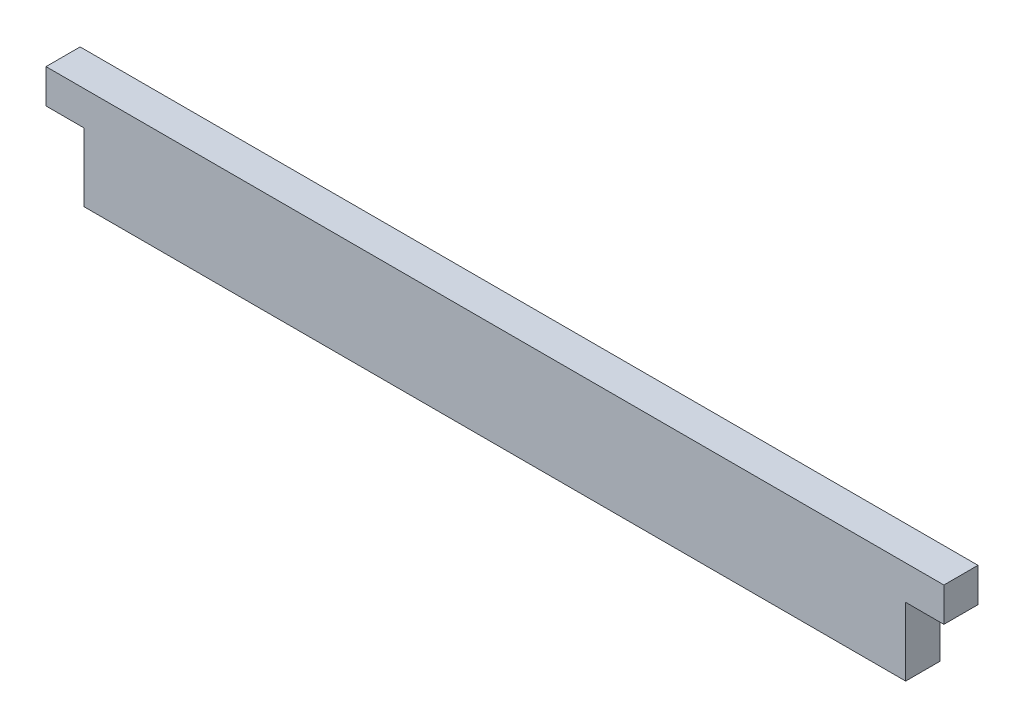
ISO-10303-21;
HEADER;
FILE_DESCRIPTION(('STEP AP214'),'2;1');
FILE_NAME('part.step','',(''),(''),'','','');
FILE_SCHEMA(('AUTOMOTIVE_DESIGN { 1 0 10303 214 1 1 1 1 }'));
ENDSEC;
DATA;
#1=APPLICATION_CONTEXT('core data for automotive mechanical design processes');
#2=APPLICATION_PROTOCOL_DEFINITION('international standard','automotive_design',2000,#1);
#3=PRODUCT_CONTEXT('',#1,'mechanical');
#4=PRODUCT('Part','Part','',(#3));
#5=PRODUCT_RELATED_PRODUCT_CATEGORY('part','',(#4));
#6=PRODUCT_DEFINITION_FORMATION('','',#4);
#7=PRODUCT_DEFINITION_CONTEXT('part definition',#1,'design');
#8=PRODUCT_DEFINITION('design','',#6,#7);
#9=PRODUCT_DEFINITION_SHAPE('','',#8);
#10=(LENGTH_UNIT() NAMED_UNIT(*) SI_UNIT(.MILLI.,.METRE.));
#11=(NAMED_UNIT(*) PLANE_ANGLE_UNIT() SI_UNIT($,.RADIAN.));
#12=(NAMED_UNIT(*) SI_UNIT($,.STERADIAN.) SOLID_ANGLE_UNIT());
#13=UNCERTAINTY_MEASURE_WITH_UNIT(LENGTH_MEASURE(1.E-05),#10,'distance_accuracy_value','');
#14=(GEOMETRIC_REPRESENTATION_CONTEXT(3) GLOBAL_UNCERTAINTY_ASSIGNED_CONTEXT((#13)) GLOBAL_UNIT_ASSIGNED_CONTEXT((#10,
#11,#12)) REPRESENTATION_CONTEXT('',''));
#15=CARTESIAN_POINT('',(0.,0.,0.));
#16=DIRECTION('',(0.,0.,1.));
#17=DIRECTION('',(1.,0.,0.));
#18=AXIS2_PLACEMENT_3D('',#15,#16,#17);
#19=CARTESIAN_POINT('',(80.01,0.,-3.175));
#20=DIRECTION('',(-1.,0.,0.));
#21=DIRECTION('',(0.,0.,1.));
#22=AXIS2_PLACEMENT_3D('',#19,#20,#21);
#23=PLANE('',#22);
#24=DIRECTION('',(0.,-1.,0.));
#25=VECTOR('',#24,1.);
#26=CARTESIAN_POINT('',(80.01,0.,0.));
#27=LINE('',#26,#25);
#28=CARTESIAN_POINT('',(80.01,6.35,0.));
#29=VERTEX_POINT('',#28);
#30=CARTESIAN_POINT('',(80.01,0.,0.));
#31=VERTEX_POINT('',#30);
#32=EDGE_CURVE('E129',#29,#31,#27,.T.);
#33=ORIENTED_EDGE('',*,*,#32,.T.);
#34=DIRECTION('',(0.,0.,1.));
#35=VECTOR('',#34,1.);
#36=CARTESIAN_POINT('',(80.01,0.,-3.175));
#37=LINE('',#36,#35);
#38=CARTESIAN_POINT('',(80.01,0.,-3.175));
#39=VERTEX_POINT('',#38);
#40=EDGE_CURVE('E11',#39,#31,#37,.T.);
#41=ORIENTED_EDGE('',*,*,#40,.F.);
#42=DIRECTION('',(0.,-1.,0.));
#43=VECTOR('',#42,1.);
#44=CARTESIAN_POINT('',(80.01,0.,-3.175));
#45=LINE('',#44,#43);
#46=CARTESIAN_POINT('',(80.01,6.35,-3.175));
#47=VERTEX_POINT('',#46);
#48=EDGE_CURVE('E51',#47,#39,#45,.T.);
#49=ORIENTED_EDGE('',*,*,#48,.F.);
#50=DIRECTION('',(0.,0.,1.));
#51=VECTOR('',#50,1.);
#52=CARTESIAN_POINT('',(80.01,6.35,-3.175));
#53=LINE('',#52,#51);
#54=EDGE_CURVE('E36',#47,#29,#53,.T.);
#55=ORIENTED_EDGE('',*,*,#54,.T.);
#56=EDGE_LOOP('',(#33,#41,#49,#55));
#57=FACE_BOUND('',#56,.T.);
#58=ADVANCED_FACE('F33',(#57),#23,.F.);
#59=CARTESIAN_POINT('',(0.,0.,-3.175));
#60=DIRECTION('',(0.,-1.,0.));
#61=DIRECTION('',(0.,0.,-1.));
#62=AXIS2_PLACEMENT_3D('',#59,#60,#61);
#63=PLANE('',#62);
#64=DIRECTION('',(1.,0.,0.));
#65=VECTOR('',#64,1.);
#66=CARTESIAN_POINT('',(0.,0.,0.));
#67=LINE('',#66,#65);
#68=CARTESIAN_POINT('',(3.556,0.,0.));
#69=VERTEX_POINT('',#68);
#70=EDGE_CURVE('E145',#69,#31,#67,.T.);
#71=ORIENTED_EDGE('',*,*,#70,.F.);
#72=DIRECTION('',(0.,0.,1.));
#73=VECTOR('',#72,1.);
#74=CARTESIAN_POINT('',(3.556,0.,-3.175));
#75=LINE('',#74,#73);
#76=CARTESIAN_POINT('',(3.556,0.,-3.175));
#77=VERTEX_POINT('',#76);
#78=EDGE_CURVE('E42',#77,#69,#75,.T.);
#79=ORIENTED_EDGE('',*,*,#78,.F.);
#80=DIRECTION('',(1.,0.,0.));
#81=VECTOR('',#80,1.);
#82=CARTESIAN_POINT('',(0.,0.,-3.175));
#83=LINE('',#82,#81);
#84=EDGE_CURVE('E109',#77,#39,#83,.T.);
#85=ORIENTED_EDGE('',*,*,#84,.T.);
#86=ORIENTED_EDGE('',*,*,#40,.T.);
#87=EDGE_LOOP('',(#71,#79,#85,#86));
#88=FACE_BOUND('',#87,.T.);
#89=ADVANCED_FACE('F172',(#88),#63,.T.);
#90=CARTESIAN_POINT('',(3.556,0.,-3.175));
#91=DIRECTION('',(1.,0.,0.));
#92=DIRECTION('',(0.,1.,0.));
#93=AXIS2_PLACEMENT_3D('',#90,#91,#92);
#94=PLANE('',#93);
#95=DIRECTION('',(0.,1.,0.));
#96=VECTOR('',#95,1.);
#97=CARTESIAN_POINT('',(3.556,0.,0.));
#98=LINE('',#97,#96);
#99=CARTESIAN_POINT('',(3.556,6.35,0.));
#100=VERTEX_POINT('',#99);
#101=EDGE_CURVE('E114',#69,#100,#98,.T.);
#102=ORIENTED_EDGE('',*,*,#101,.T.);
#103=DIRECTION('',(0.,0.,1.));
#104=VECTOR('',#103,1.);
#105=CARTESIAN_POINT('',(3.556,6.35,-3.175));
#106=LINE('',#105,#104);
#107=CARTESIAN_POINT('',(3.556,6.35,-3.175));
#108=VERTEX_POINT('',#107);
#109=EDGE_CURVE('E112',#108,#100,#106,.T.);
#110=ORIENTED_EDGE('',*,*,#109,.F.);
#111=DIRECTION('',(0.,1.,0.));
#112=VECTOR('',#111,1.);
#113=CARTESIAN_POINT('',(3.556,0.,-3.175));
#114=LINE('',#113,#112);
#115=EDGE_CURVE('E103',#77,#108,#114,.T.);
#116=ORIENTED_EDGE('',*,*,#115,.F.);
#117=ORIENTED_EDGE('',*,*,#78,.T.);
#118=EDGE_LOOP('',(#102,#110,#116,#117));
#119=FACE_BOUND('',#118,.T.);
#120=ADVANCED_FACE('F113',(#119),#94,.F.);
#121=CARTESIAN_POINT('',(0.,6.35,-3.175));
#122=DIRECTION('',(0.,1.,0.));
#123=DIRECTION('',(0.,0.,1.));
#124=AXIS2_PLACEMENT_3D('',#121,#122,#123);
#125=PLANE('',#124);
#126=DIRECTION('',(-1.,0.,0.));
#127=VECTOR('',#126,1.);
#128=CARTESIAN_POINT('',(0.,6.35,0.));
#129=LINE('',#128,#127);
#130=CARTESIAN_POINT('',(0.,6.35,0.));
#131=VERTEX_POINT('',#130);
#132=EDGE_CURVE('E142',#100,#131,#129,.T.);
#133=ORIENTED_EDGE('',*,*,#132,.T.);
#134=DIRECTION('',(0.,0.,1.));
#135=VECTOR('',#134,1.);
#136=CARTESIAN_POINT('',(0.,6.35,-3.175));
#137=LINE('',#136,#135);
#138=CARTESIAN_POINT('',(0.,6.35,-3.175));
#139=VERTEX_POINT('',#138);
#140=EDGE_CURVE('E117',#139,#131,#137,.T.);
#141=ORIENTED_EDGE('',*,*,#140,.F.);
#142=DIRECTION('',(-1.,0.,0.));
#143=VECTOR('',#142,1.);
#144=CARTESIAN_POINT('',(0.,6.35,-3.175));
#145=LINE('',#144,#143);
#146=EDGE_CURVE('E107',#108,#139,#145,.T.);
#147=ORIENTED_EDGE('',*,*,#146,.F.);
#148=ORIENTED_EDGE('',*,*,#109,.T.);
#149=EDGE_LOOP('',(#133,#141,#147,#148));
#150=FACE_BOUND('',#149,.T.);
#151=ADVANCED_FACE('F119',(#150),#125,.F.);
#152=CARTESIAN_POINT('',(0.,0.,-3.175));
#153=DIRECTION('',(1.,0.,0.));
#154=DIRECTION('',(0.,1.,0.));
#155=AXIS2_PLACEMENT_3D('',#152,#153,#154);
#156=PLANE('',#155);
#157=DIRECTION('',(0.,1.,0.));
#158=VECTOR('',#157,1.);
#159=CARTESIAN_POINT('',(0.,0.,0.));
#160=LINE('',#159,#158);
#161=CARTESIAN_POINT('',(0.,9.525,0.));
#162=VERTEX_POINT('',#161);
#163=EDGE_CURVE('E140',#131,#162,#160,.T.);
#164=ORIENTED_EDGE('',*,*,#163,.T.);
#165=DIRECTION('',(0.,0.,1.));
#166=VECTOR('',#165,1.);
#167=CARTESIAN_POINT('',(0.,9.525,-3.175));
#168=LINE('',#167,#166);
#169=CARTESIAN_POINT('',(0.,9.525,-3.175));
#170=VERTEX_POINT('',#169);
#171=EDGE_CURVE('E150',#170,#162,#168,.T.);
#172=ORIENTED_EDGE('',*,*,#171,.F.);
#173=DIRECTION('',(0.,1.,0.));
#174=VECTOR('',#173,1.);
#175=CARTESIAN_POINT('',(0.,0.,-3.175));
#176=LINE('',#175,#174);
#177=EDGE_CURVE('E122',#139,#170,#176,.T.);
#178=ORIENTED_EDGE('',*,*,#177,.F.);
#179=ORIENTED_EDGE('',*,*,#140,.T.);
#180=EDGE_LOOP('',(#164,#172,#178,#179));
#181=FACE_BOUND('',#180,.T.);
#182=ADVANCED_FACE('F185',(#181),#156,.F.);
#183=CARTESIAN_POINT('',(0.,9.525,-3.175));
#184=DIRECTION('',(0.,-1.,0.));
#185=DIRECTION('',(0.,0.,-1.));
#186=AXIS2_PLACEMENT_3D('',#183,#184,#185);
#187=PLANE('',#186);
#188=DIRECTION('',(1.,0.,0.));
#189=VECTOR('',#188,1.);
#190=CARTESIAN_POINT('',(0.,9.525,0.));
#191=LINE('',#190,#189);
#192=CARTESIAN_POINT('',(83.566,9.525,0.));
#193=VERTEX_POINT('',#192);
#194=EDGE_CURVE('E137',#162,#193,#191,.T.);
#195=ORIENTED_EDGE('',*,*,#194,.T.);
#196=DIRECTION('',(0.,0.,1.));
#197=VECTOR('',#196,1.);
#198=CARTESIAN_POINT('',(83.566,9.525,-3.175));
#199=LINE('',#198,#197);
#200=CARTESIAN_POINT('',(83.566,9.525,-3.175));
#201=VERTEX_POINT('',#200);
#202=EDGE_CURVE('E153',#201,#193,#199,.T.);
#203=ORIENTED_EDGE('',*,*,#202,.F.);
#204=DIRECTION('',(1.,0.,0.));
#205=VECTOR('',#204,1.);
#206=CARTESIAN_POINT('',(0.,9.525,-3.175));
#207=LINE('',#206,#205);
#208=EDGE_CURVE('E124',#170,#201,#207,.T.);
#209=ORIENTED_EDGE('',*,*,#208,.F.);
#210=ORIENTED_EDGE('',*,*,#171,.T.);
#211=EDGE_LOOP('',(#195,#203,#209,#210));
#212=FACE_BOUND('',#211,.T.);
#213=ADVANCED_FACE('F168',(#212),#187,.F.);
#214=CARTESIAN_POINT('',(83.566,0.,-3.175));
#215=DIRECTION('',(1.,0.,0.));
#216=DIRECTION('',(0.,0.,-1.));
#217=AXIS2_PLACEMENT_3D('',#214,#215,#216);
#218=PLANE('',#217);
#219=DIRECTION('',(0.,1.,0.));
#220=VECTOR('',#219,1.);
#221=CARTESIAN_POINT('',(83.566,0.,0.));
#222=LINE('',#221,#220);
#223=CARTESIAN_POINT('',(83.566,6.35,0.));
#224=VERTEX_POINT('',#223);
#225=EDGE_CURVE('E134',#224,#193,#222,.T.);
#226=ORIENTED_EDGE('',*,*,#225,.F.);
#227=DIRECTION('',(0.,0.,1.));
#228=VECTOR('',#227,1.);
#229=CARTESIAN_POINT('',(83.566,6.35,-3.175));
#230=LINE('',#229,#228);
#231=CARTESIAN_POINT('',(83.566,6.35,-3.175));
#232=VERTEX_POINT('',#231);
#233=EDGE_CURVE('E154',#232,#224,#230,.T.);
#234=ORIENTED_EDGE('',*,*,#233,.F.);
#235=DIRECTION('',(0.,1.,0.));
#236=VECTOR('',#235,1.);
#237=CARTESIAN_POINT('',(83.566,0.,-3.175));
#238=LINE('',#237,#236);
#239=EDGE_CURVE('E200',#232,#201,#238,.T.);
#240=ORIENTED_EDGE('',*,*,#239,.T.);
#241=ORIENTED_EDGE('',*,*,#202,.T.);
#242=EDGE_LOOP('',(#226,#234,#240,#241));
#243=FACE_BOUND('',#242,.T.);
#244=ADVANCED_FACE('F162',(#243),#218,.T.);
#245=CARTESIAN_POINT('',(0.,6.35,-3.175));
#246=DIRECTION('',(0.,-1.,0.));
#247=DIRECTION('',(0.,0.,-1.));
#248=AXIS2_PLACEMENT_3D('',#245,#246,#247);
#249=PLANE('',#248);
#250=DIRECTION('',(1.,0.,0.));
#251=VECTOR('',#250,1.);
#252=CARTESIAN_POINT('',(0.,6.35,0.));
#253=LINE('',#252,#251);
#254=EDGE_CURVE('E131',#29,#224,#253,.T.);
#255=ORIENTED_EDGE('',*,*,#254,.F.);
#256=ORIENTED_EDGE('',*,*,#54,.F.);
#257=DIRECTION('',(1.,0.,0.));
#258=VECTOR('',#257,1.);
#259=CARTESIAN_POINT('',(0.,6.35,-3.175));
#260=LINE('',#259,#258);
#261=EDGE_CURVE('E201',#47,#232,#260,.T.);
#262=ORIENTED_EDGE('',*,*,#261,.T.);
#263=ORIENTED_EDGE('',*,*,#233,.T.);
#264=EDGE_LOOP('',(#255,#256,#262,#263));
#265=FACE_BOUND('',#264,.T.);
#266=ADVANCED_FACE('F160',(#265),#249,.T.);
#267=CARTESIAN_POINT('',(0.,0.,-3.175));
#268=DIRECTION('',(0.,0.,1.));
#269=DIRECTION('',(1.,0.,0.));
#270=AXIS2_PLACEMENT_3D('',#267,#268,#269);
#271=PLANE('',#270);
#272=ORIENTED_EDGE('',*,*,#48,.T.);
#273=ORIENTED_EDGE('',*,*,#84,.F.);
#274=ORIENTED_EDGE('',*,*,#115,.T.);
#275=ORIENTED_EDGE('',*,*,#146,.T.);
#276=ORIENTED_EDGE('',*,*,#177,.T.);
#277=ORIENTED_EDGE('',*,*,#208,.T.);
#278=ORIENTED_EDGE('',*,*,#239,.F.);
#279=ORIENTED_EDGE('',*,*,#261,.F.);
#280=EDGE_LOOP('',(#272,#273,#274,#275,#276,#277,#278,#279));
#281=FACE_BOUND('',#280,.T.);
#282=ADVANCED_FACE('F105',(#281),#271,.F.);
#283=CARTESIAN_POINT('',(0.,0.,0.));
#284=DIRECTION('',(0.,0.,1.));
#285=DIRECTION('',(1.,0.,0.));
#286=AXIS2_PLACEMENT_3D('',#283,#284,#285);
#287=PLANE('',#286);
#288=ORIENTED_EDGE('',*,*,#32,.F.);
#289=ORIENTED_EDGE('',*,*,#254,.T.);
#290=ORIENTED_EDGE('',*,*,#225,.T.);
#291=ORIENTED_EDGE('',*,*,#194,.F.);
#292=ORIENTED_EDGE('',*,*,#163,.F.);
#293=ORIENTED_EDGE('',*,*,#132,.F.);
#294=ORIENTED_EDGE('',*,*,#101,.F.);
#295=ORIENTED_EDGE('',*,*,#70,.T.);
#296=EDGE_LOOP('',(#288,#289,#290,#291,#292,#293,#294,#295));
#297=FACE_BOUND('',#296,.T.);
#298=ADVANCED_FACE('F159',(#297),#287,.T.);
#299=CLOSED_SHELL('',(#58,#89,#120,#151,#182,#213,#244,#266,#282,#298));
#300=MANIFOLD_SOLID_BREP('B2',#299);
#301=ADVANCED_BREP_SHAPE_REPRESENTATION('',(#18,#300),#14);
#302=SHAPE_DEFINITION_REPRESENTATION(#9,#301);
ENDSEC;
END-ISO-10303-21;
